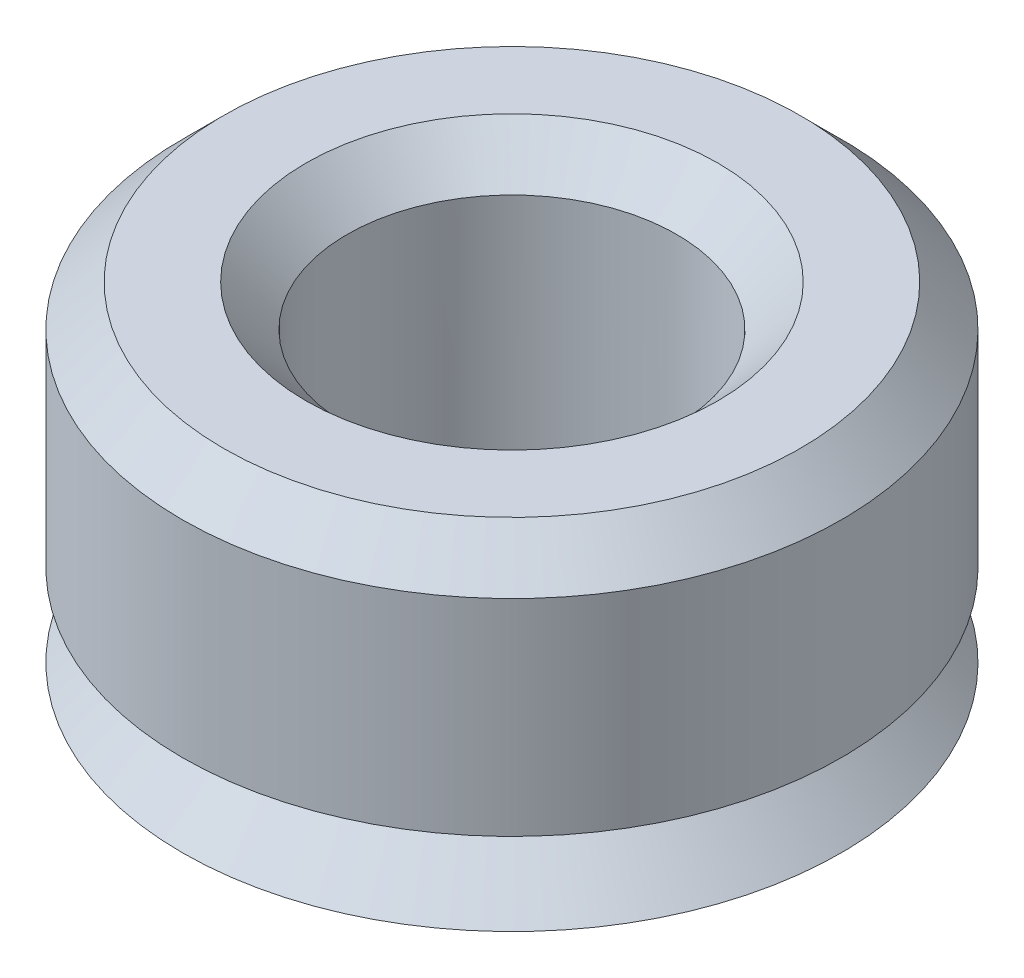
ISO-10303-21;
HEADER;
FILE_DESCRIPTION(('STEP AP214'),'2;1');
FILE_NAME('part.step','',(''),(''),'','','');
FILE_SCHEMA(('AUTOMOTIVE_DESIGN { 1 0 10303 214 1 1 1 1 }'));
ENDSEC;
DATA;
#1=APPLICATION_CONTEXT('core data for automotive mechanical design processes');
#2=APPLICATION_PROTOCOL_DEFINITION('international standard','automotive_design',2000,#1);
#3=PRODUCT_CONTEXT('',#1,'mechanical');
#4=PRODUCT('Part','Part','',(#3));
#5=PRODUCT_RELATED_PRODUCT_CATEGORY('part','',(#4));
#6=PRODUCT_DEFINITION_FORMATION('','',#4);
#7=PRODUCT_DEFINITION_CONTEXT('part definition',#1,'design');
#8=PRODUCT_DEFINITION('design','',#6,#7);
#9=PRODUCT_DEFINITION_SHAPE('','',#8);
#10=(LENGTH_UNIT() NAMED_UNIT(*) SI_UNIT(.MILLI.,.METRE.));
#11=(NAMED_UNIT(*) PLANE_ANGLE_UNIT() SI_UNIT($,.RADIAN.));
#12=(NAMED_UNIT(*) SI_UNIT($,.STERADIAN.) SOLID_ANGLE_UNIT());
#13=UNCERTAINTY_MEASURE_WITH_UNIT(LENGTH_MEASURE(1.E-05),#10,'distance_accuracy_value','');
#14=(GEOMETRIC_REPRESENTATION_CONTEXT(3) GLOBAL_UNCERTAINTY_ASSIGNED_CONTEXT((#13)) GLOBAL_UNIT_ASSIGNED_CONTEXT((#10,
#11,#12)) REPRESENTATION_CONTEXT('',''));
#15=CARTESIAN_POINT('',(0.,0.,0.));
#16=DIRECTION('',(0.,0.,1.));
#17=DIRECTION('',(1.,0.,0.));
#18=AXIS2_PLACEMENT_3D('',#15,#16,#17);
#19=CARTESIAN_POINT('',(0.,0.,2.));
#20=DIRECTION('',(0.,-1.,0.));
#21=DIRECTION('',(0.,0.,-1.));
#22=AXIS2_PLACEMENT_3D('',#19,#20,#21);
#23=PLANE('',#22);
#24=CARTESIAN_POINT('',(0.,0.,0.));
#25=DIRECTION('',(0.,-1.,0.));
#26=DIRECTION('',(0.,0.,-1.));
#27=AXIS2_PLACEMENT_3D('',#24,#25,#26);
#28=CIRCLE('',#27,2.5);
#29=CARTESIAN_POINT('',(0.,0.,-2.5));
#30=VERTEX_POINT('',#29);
#31=EDGE_CURVE('E51',#30,#30,#28,.F.);
#32=ORIENTED_EDGE('',*,*,#31,.T.);
#33=EDGE_LOOP('',(#32));
#34=FACE_BOUND('',#33,.T.);
#35=CARTESIAN_POINT('',(0.,0.,0.));
#36=DIRECTION('',(0.,1.,0.));
#37=DIRECTION('',(0.,0.,1.));
#38=AXIS2_PLACEMENT_3D('',#35,#36,#37);
#39=CIRCLE('',#38,3.99999999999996);
#40=CARTESIAN_POINT('',(0.,0.,3.99999999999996));
#41=VERTEX_POINT('',#40);
#42=EDGE_CURVE('E54',#41,#41,#39,.T.);
#43=ORIENTED_EDGE('',*,*,#42,.F.);
#44=EDGE_LOOP('',(#43));
#45=FACE_BOUND('',#44,.T.);
#46=ADVANCED_FACE('F28',(#34,#45),#23,.T.);
#47=CARTESIAN_POINT('',(0.,1.,0.));
#48=DIRECTION('',(0.,-1.,0.));
#49=DIRECTION('',(0.,0.,-1.));
#50=AXIS2_PLACEMENT_3D('',#47,#48,#49);
#51=CONICAL_SURFACE('',#50,3.,0.785398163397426);
#52=ORIENTED_EDGE('',*,*,#42,.T.);
#53=EDGE_LOOP('',(#52));
#54=FACE_BOUND('',#53,.T.);
#55=CARTESIAN_POINT('',(0.,1.,0.));
#56=DIRECTION('',(0.,1.,0.));
#57=DIRECTION('',(0.,0.,1.));
#58=AXIS2_PLACEMENT_3D('',#55,#56,#57);
#59=CIRCLE('',#58,3.);
#60=CARTESIAN_POINT('',(0.,1.,3.));
#61=VERTEX_POINT('',#60);
#62=EDGE_CURVE('E57',#61,#61,#59,.T.);
#63=ORIENTED_EDGE('',*,*,#62,.F.);
#64=EDGE_LOOP('',(#63));
#65=FACE_BOUND('',#64,.T.);
#66=ADVANCED_FACE('F68',(#54,#65),#51,.T.);
#67=CARTESIAN_POINT('',(0.,1.,3.));
#68=DIRECTION('',(0.,-1.,0.));
#69=DIRECTION('',(0.,0.,-1.));
#70=AXIS2_PLACEMENT_3D('',#67,#68,#69);
#71=PLANE('',#70);
#72=ORIENTED_EDGE('',*,*,#62,.T.);
#73=EDGE_LOOP('',(#72));
#74=FACE_BOUND('',#73,.T.);
#75=CARTESIAN_POINT('',(0.,1.,0.));
#76=DIRECTION('',(0.,1.,0.));
#77=DIRECTION('',(0.,0.,1.));
#78=AXIS2_PLACEMENT_3D('',#75,#76,#77);
#79=CIRCLE('',#78,4.);
#80=CARTESIAN_POINT('',(0.,1.,4.));
#81=VERTEX_POINT('',#80);
#82=EDGE_CURVE('E60',#81,#81,#79,.T.);
#83=ORIENTED_EDGE('',*,*,#82,.F.);
#84=EDGE_LOOP('',(#83));
#85=FACE_BOUND('',#84,.T.);
#86=ADVANCED_FACE('F66',(#74,#85),#71,.T.);
#87=CARTESIAN_POINT('',(0.,0.,0.));
#88=DIRECTION('',(0.,1.,0.));
#89=DIRECTION('',(0.,0.,1.));
#90=AXIS2_PLACEMENT_3D('',#87,#88,#89);
#91=CYLINDRICAL_SURFACE('',#90,4.);
#92=CARTESIAN_POINT('',(0.,3.5,0.));
#93=DIRECTION('',(0.,1.,0.));
#94=DIRECTION('',(0.,0.,1.));
#95=AXIS2_PLACEMENT_3D('',#92,#93,#94);
#96=CIRCLE('',#95,4.);
#97=CARTESIAN_POINT('',(0.,3.5,4.));
#98=VERTEX_POINT('',#97);
#99=EDGE_CURVE('E10',#98,#98,#96,.F.);
#100=ORIENTED_EDGE('',*,*,#99,.T.);
#101=EDGE_LOOP('',(#100));
#102=FACE_BOUND('',#101,.T.);
#103=ORIENTED_EDGE('',*,*,#82,.T.);
#104=EDGE_LOOP('',(#103));
#105=FACE_BOUND('',#104,.T.);
#106=ADVANCED_FACE('F64',(#102,#105),#91,.T.);
#107=CARTESIAN_POINT('',(0.,4.,4.));
#108=DIRECTION('',(0.,1.,0.));
#109=DIRECTION('',(0.,0.,1.));
#110=AXIS2_PLACEMENT_3D('',#107,#108,#109);
#111=PLANE('',#110);
#112=CARTESIAN_POINT('',(0.,4.,0.));
#113=DIRECTION('',(0.,1.,0.));
#114=DIRECTION('',(0.,0.,1.));
#115=AXIS2_PLACEMENT_3D('',#112,#113,#114);
#116=CIRCLE('',#115,2.5);
#117=CARTESIAN_POINT('',(0.,4.,2.5));
#118=VERTEX_POINT('',#117);
#119=EDGE_CURVE('E35',#118,#118,#116,.F.);
#120=ORIENTED_EDGE('',*,*,#119,.T.);
#121=EDGE_LOOP('',(#120));
#122=FACE_BOUND('',#121,.T.);
#123=CARTESIAN_POINT('',(0.,4.,0.));
#124=DIRECTION('',(0.,1.,0.));
#125=DIRECTION('',(0.,0.,1.));
#126=AXIS2_PLACEMENT_3D('',#123,#124,#125);
#127=CIRCLE('',#126,3.5);
#128=CARTESIAN_POINT('',(0.,4.,3.5));
#129=VERTEX_POINT('',#128);
#130=EDGE_CURVE('E39',#129,#129,#127,.T.);
#131=ORIENTED_EDGE('',*,*,#130,.T.);
#132=EDGE_LOOP('',(#131));
#133=FACE_BOUND('',#132,.T.);
#134=ADVANCED_FACE('F75',(#122,#133),#111,.T.);
#135=CARTESIAN_POINT('',(0.,0.,0.));
#136=DIRECTION('',(0.,1.,0.));
#137=DIRECTION('',(0.,0.,1.));
#138=AXIS2_PLACEMENT_3D('',#135,#136,#137);
#139=CYLINDRICAL_SURFACE('',#138,2.);
#140=CARTESIAN_POINT('',(0.,0.500000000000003,0.));
#141=DIRECTION('',(0.,-1.,0.));
#142=DIRECTION('',(0.,0.,-1.));
#143=AXIS2_PLACEMENT_3D('',#140,#141,#142);
#144=CIRCLE('',#143,2.);
#145=CARTESIAN_POINT('',(0.,0.500000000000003,-2.));
#146=VERTEX_POINT('',#145);
#147=EDGE_CURVE('E43',#146,#146,#144,.T.);
#148=ORIENTED_EDGE('',*,*,#147,.T.);
#149=EDGE_LOOP('',(#148));
#150=FACE_BOUND('',#149,.T.);
#151=CARTESIAN_POINT('',(0.,3.5,0.));
#152=DIRECTION('',(0.,1.,0.));
#153=DIRECTION('',(0.,0.,1.));
#154=AXIS2_PLACEMENT_3D('',#151,#152,#153);
#155=CIRCLE('',#154,2.);
#156=CARTESIAN_POINT('',(0.,3.5,2.));
#157=VERTEX_POINT('',#156);
#158=EDGE_CURVE('E48',#157,#157,#155,.T.);
#159=ORIENTED_EDGE('',*,*,#158,.T.);
#160=EDGE_LOOP('',(#159));
#161=FACE_BOUND('',#160,.T.);
#162=ADVANCED_FACE('F89',(#150,#161),#139,.F.);
#163=CARTESIAN_POINT('',(0.,0.,0.));
#164=DIRECTION('',(0.,-1.,0.));
#165=DIRECTION('',(0.,0.,-1.));
#166=AXIS2_PLACEMENT_3D('',#163,#164,#165);
#167=CONICAL_SURFACE('',#166,2.5,0.785398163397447);
#168=ORIENTED_EDGE('',*,*,#147,.F.);
#169=EDGE_LOOP('',(#168));
#170=FACE_BOUND('',#169,.T.);
#171=ORIENTED_EDGE('',*,*,#31,.F.);
#172=EDGE_LOOP('',(#171));
#173=FACE_BOUND('',#172,.T.);
#174=ADVANCED_FACE('F86',(#170,#173),#167,.F.);
#175=CARTESIAN_POINT('',(0.,3.5,0.));
#176=DIRECTION('',(0.,1.,0.));
#177=DIRECTION('',(0.,0.,1.));
#178=AXIS2_PLACEMENT_3D('',#175,#176,#177);
#179=CONICAL_SURFACE('',#178,2.,0.78539816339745);
#180=ORIENTED_EDGE('',*,*,#119,.F.);
#181=EDGE_LOOP('',(#180));
#182=FACE_BOUND('',#181,.T.);
#183=ORIENTED_EDGE('',*,*,#158,.F.);
#184=EDGE_LOOP('',(#183));
#185=FACE_BOUND('',#184,.T.);
#186=ADVANCED_FACE('F88',(#182,#185),#179,.F.);
#187=CARTESIAN_POINT('',(0.,4.,0.));
#188=DIRECTION('',(0.,-1.,0.));
#189=DIRECTION('',(0.,0.,-1.));
#190=AXIS2_PLACEMENT_3D('',#187,#188,#189);
#191=CONICAL_SURFACE('',#190,3.5,0.785398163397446);
#192=ORIENTED_EDGE('',*,*,#99,.F.);
#193=EDGE_LOOP('',(#192));
#194=FACE_BOUND('',#193,.T.);
#195=ORIENTED_EDGE('',*,*,#130,.F.);
#196=EDGE_LOOP('',(#195));
#197=FACE_BOUND('',#196,.T.);
#198=ADVANCED_FACE('F30',(#194,#197),#191,.T.);
#199=CLOSED_SHELL('',(#46,#66,#86,#106,#134,#162,#174,#186,#198));
#200=MANIFOLD_SOLID_BREP('B2',#199);
#201=ADVANCED_BREP_SHAPE_REPRESENTATION('',(#18,#200),#14);
#202=SHAPE_DEFINITION_REPRESENTATION(#9,#201);
ENDSEC;
END-ISO-10303-21;
